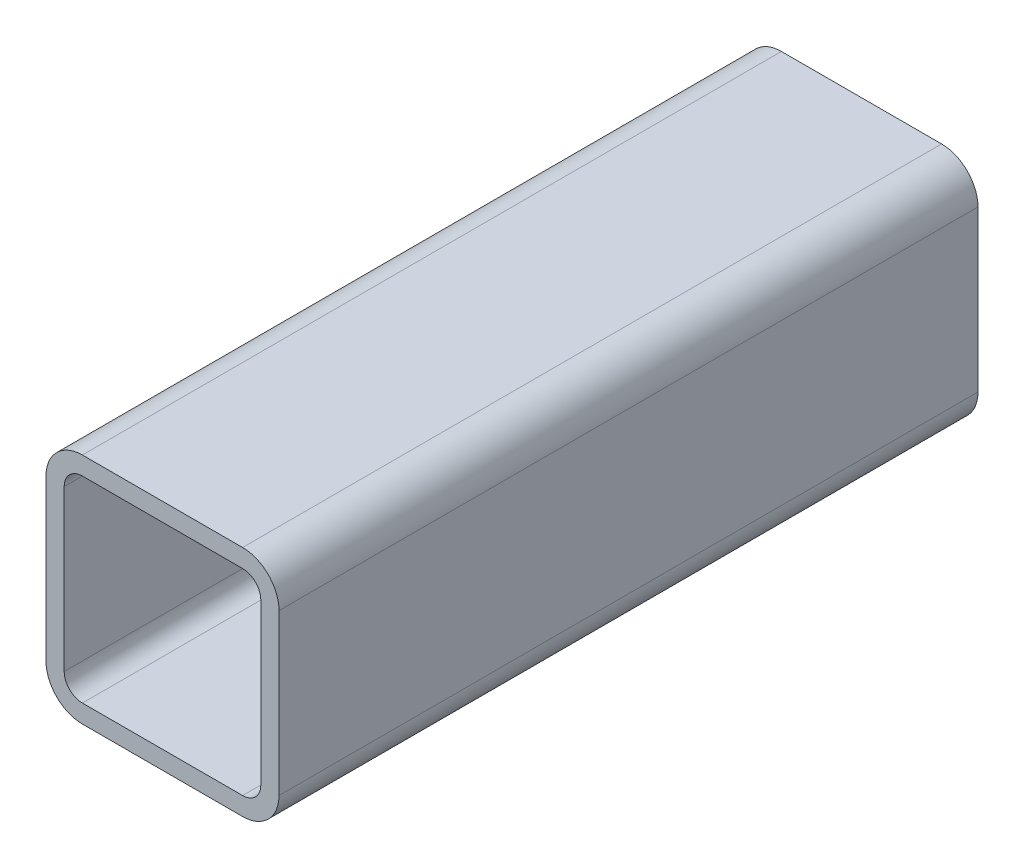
ISO-10303-21;
HEADER;
FILE_DESCRIPTION(('STEP AP214'),'2;1');
FILE_NAME('part.step','',(''),(''),'','','');
FILE_SCHEMA(('AUTOMOTIVE_DESIGN { 1 0 10303 214 1 1 1 1 }'));
ENDSEC;
DATA;
#1=APPLICATION_CONTEXT('core data for automotive mechanical design processes');
#2=APPLICATION_PROTOCOL_DEFINITION('international standard','automotive_design',2000,#1);
#3=PRODUCT_CONTEXT('',#1,'mechanical');
#4=PRODUCT('Part','Part','',(#3));
#5=PRODUCT_RELATED_PRODUCT_CATEGORY('part','',(#4));
#6=PRODUCT_DEFINITION_FORMATION('','',#4);
#7=PRODUCT_DEFINITION_CONTEXT('part definition',#1,'design');
#8=PRODUCT_DEFINITION('design','',#6,#7);
#9=PRODUCT_DEFINITION_SHAPE('','',#8);
#10=(LENGTH_UNIT() NAMED_UNIT(*) SI_UNIT(.MILLI.,.METRE.));
#11=(NAMED_UNIT(*) PLANE_ANGLE_UNIT() SI_UNIT($,.RADIAN.));
#12=(NAMED_UNIT(*) SI_UNIT($,.STERADIAN.) SOLID_ANGLE_UNIT());
#13=UNCERTAINTY_MEASURE_WITH_UNIT(LENGTH_MEASURE(1.E-05),#10,'distance_accuracy_value','');
#14=(GEOMETRIC_REPRESENTATION_CONTEXT(3) GLOBAL_UNCERTAINTY_ASSIGNED_CONTEXT((#13)) GLOBAL_UNIT_ASSIGNED_CONTEXT((#10,
#11,#12)) REPRESENTATION_CONTEXT('',''));
#15=CARTESIAN_POINT('',(0.,0.,0.));
#16=DIRECTION('',(0.,0.,1.));
#17=DIRECTION('',(1.,0.,0.));
#18=AXIS2_PLACEMENT_3D('',#15,#16,#17);
#19=CARTESIAN_POINT('',(17.5501778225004,87.7827651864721,304.8));
#20=DIRECTION('',(0.,0.,1.));
#21=DIRECTION('',(1.,0.,0.));
#22=AXIS2_PLACEMENT_3D('',#19,#20,#21);
#23=PLANE('',#22);
#24=CARTESIAN_POINT('',(17.5501778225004,87.7827651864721,304.8));
#25=DIRECTION('',(0.,0.,1.));
#26=DIRECTION('',(1.,0.,0.));
#27=AXIS2_PLACEMENT_3D('',#24,#25,#26);
#28=CIRCLE('',#27,15.875);
#29=CARTESIAN_POINT('',(17.5501778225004,103.657765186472,304.8));
#30=VERTEX_POINT('',#29);
#31=CARTESIAN_POINT('',(1.67517782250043,87.7827651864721,304.8));
#32=VERTEX_POINT('',#31);
#33=EDGE_CURVE('E211',#30,#32,#28,.T.);
#34=ORIENTED_EDGE('',*,*,#33,.T.);
#35=DIRECTION('',(0.,-1.,0.));
#36=VECTOR('',#35,1.);
#37=CARTESIAN_POINT('',(1.67517782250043,17.9327651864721,304.8));
#38=LINE('',#37,#36);
#39=CARTESIAN_POINT('',(1.67517782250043,17.9327651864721,304.8));
#40=VERTEX_POINT('',#39);
#41=EDGE_CURVE('E214',#32,#40,#38,.T.);
#42=ORIENTED_EDGE('',*,*,#41,.T.);
#43=CARTESIAN_POINT('',(17.5501778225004,17.9327651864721,304.8));
#44=DIRECTION('',(0.,0.,1.));
#45=DIRECTION('',(1.,0.,0.));
#46=AXIS2_PLACEMENT_3D('',#43,#44,#45);
#47=CIRCLE('',#46,15.875);
#48=CARTESIAN_POINT('',(17.5501778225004,2.05776518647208,304.8));
#49=VERTEX_POINT('',#48);
#50=EDGE_CURVE('E217',#40,#49,#47,.T.);
#51=ORIENTED_EDGE('',*,*,#50,.T.);
#52=DIRECTION('',(1.,0.,0.));
#53=VECTOR('',#52,1.);
#54=CARTESIAN_POINT('',(87.4001778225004,2.05776518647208,304.8));
#55=LINE('',#54,#53);
#56=CARTESIAN_POINT('',(87.4001778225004,2.05776518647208,304.8));
#57=VERTEX_POINT('',#56);
#58=EDGE_CURVE('E219',#49,#57,#55,.T.);
#59=ORIENTED_EDGE('',*,*,#58,.T.);
#60=CARTESIAN_POINT('',(87.4001778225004,17.9327651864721,304.8));
#61=DIRECTION('',(0.,0.,1.));
#62=DIRECTION('',(1.,0.,0.));
#63=AXIS2_PLACEMENT_3D('',#60,#61,#62);
#64=CIRCLE('',#63,15.875);
#65=CARTESIAN_POINT('',(103.2751778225,17.9327651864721,304.8));
#66=VERTEX_POINT('',#65);
#67=EDGE_CURVE('E221',#57,#66,#64,.T.);
#68=ORIENTED_EDGE('',*,*,#67,.T.);
#69=DIRECTION('',(0.,1.,0.));
#70=VECTOR('',#69,1.);
#71=CARTESIAN_POINT('',(103.2751778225,87.7827651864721,304.8));
#72=LINE('',#71,#70);
#73=CARTESIAN_POINT('',(103.2751778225,87.7827651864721,304.8));
#74=VERTEX_POINT('',#73);
#75=EDGE_CURVE('E223',#66,#74,#72,.T.);
#76=ORIENTED_EDGE('',*,*,#75,.T.);
#77=CARTESIAN_POINT('',(87.4001778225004,87.7827651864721,304.8));
#78=DIRECTION('',(0.,0.,1.));
#79=DIRECTION('',(1.,0.,0.));
#80=AXIS2_PLACEMENT_3D('',#77,#78,#79);
#81=CIRCLE('',#80,15.875);
#82=CARTESIAN_POINT('',(87.4001778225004,103.657765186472,304.8));
#83=VERTEX_POINT('',#82);
#84=EDGE_CURVE('E225',#74,#83,#81,.T.);
#85=ORIENTED_EDGE('',*,*,#84,.T.);
#86=DIRECTION('',(-1.,0.,0.));
#87=VECTOR('',#86,1.);
#88=CARTESIAN_POINT('',(17.5501778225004,103.657765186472,304.8));
#89=LINE('',#88,#87);
#90=EDGE_CURVE('E227',#83,#30,#89,.T.);
#91=ORIENTED_EDGE('',*,*,#90,.T.);
#92=EDGE_LOOP('',(#34,#42,#51,#59,#68,#76,#85,#91));
#93=FACE_BOUND('',#92,.T.);
#94=DIRECTION('',(0.,-1.,0.));
#95=VECTOR('',#94,1.);
#96=CARTESIAN_POINT('',(9.61267782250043,17.9327651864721,304.8));
#97=LINE('',#96,#95);
#98=CARTESIAN_POINT('',(9.61267782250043,87.7827651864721,304.8));
#99=VERTEX_POINT('',#98);
#100=CARTESIAN_POINT('',(9.61267782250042,17.9327651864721,304.8));
#101=VERTEX_POINT('',#100);
#102=EDGE_CURVE('E154',#99,#101,#97,.T.);
#103=ORIENTED_EDGE('',*,*,#102,.F.);
#104=CARTESIAN_POINT('',(17.5501778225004,87.7827651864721,304.8));
#105=DIRECTION('',(0.,0.,1.));
#106=DIRECTION('',(1.,0.,0.));
#107=AXIS2_PLACEMENT_3D('',#104,#105,#106);
#108=CIRCLE('',#107,7.9375);
#109=CARTESIAN_POINT('',(17.5501778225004,95.7202651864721,304.8));
#110=VERTEX_POINT('',#109);
#111=EDGE_CURVE('E146',#110,#99,#108,.T.);
#112=ORIENTED_EDGE('',*,*,#111,.F.);
#113=DIRECTION('',(-1.,0.,0.));
#114=VECTOR('',#113,1.);
#115=CARTESIAN_POINT('',(17.5501778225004,95.7202651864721,304.8));
#116=LINE('',#115,#114);
#117=CARTESIAN_POINT('',(87.4001778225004,95.7202651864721,304.8));
#118=VERTEX_POINT('',#117);
#119=EDGE_CURVE('E179',#118,#110,#116,.T.);
#120=ORIENTED_EDGE('',*,*,#119,.F.);
#121=CARTESIAN_POINT('',(87.4001778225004,87.7827651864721,304.8));
#122=DIRECTION('',(0.,0.,1.));
#123=DIRECTION('',(1.,0.,0.));
#124=AXIS2_PLACEMENT_3D('',#121,#122,#123);
#125=CIRCLE('',#124,7.9375);
#126=CARTESIAN_POINT('',(95.3376778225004,87.7827651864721,304.8));
#127=VERTEX_POINT('',#126);
#128=EDGE_CURVE('E177',#127,#118,#125,.T.);
#129=ORIENTED_EDGE('',*,*,#128,.F.);
#130=DIRECTION('',(0.,1.,0.));
#131=VECTOR('',#130,1.);
#132=CARTESIAN_POINT('',(95.3376778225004,87.7827651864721,304.8));
#133=LINE('',#132,#131);
#134=CARTESIAN_POINT('',(95.3376778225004,17.9327651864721,304.8));
#135=VERTEX_POINT('',#134);
#136=EDGE_CURVE('E175',#135,#127,#133,.T.);
#137=ORIENTED_EDGE('',*,*,#136,.F.);
#138=CARTESIAN_POINT('',(87.4001778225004,17.9327651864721,304.8));
#139=DIRECTION('',(0.,0.,1.));
#140=DIRECTION('',(1.,0.,0.));
#141=AXIS2_PLACEMENT_3D('',#138,#139,#140);
#142=CIRCLE('',#141,7.9375);
#143=CARTESIAN_POINT('',(87.4001778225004,9.99526518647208,304.8));
#144=VERTEX_POINT('',#143);
#145=EDGE_CURVE('E173',#144,#135,#142,.T.);
#146=ORIENTED_EDGE('',*,*,#145,.F.);
#147=DIRECTION('',(1.,0.,0.));
#148=VECTOR('',#147,1.);
#149=CARTESIAN_POINT('',(87.4001778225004,9.99526518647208,304.8));
#150=LINE('',#149,#148);
#151=CARTESIAN_POINT('',(17.5501778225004,9.99526518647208,304.8));
#152=VERTEX_POINT('',#151);
#153=EDGE_CURVE('E169',#152,#144,#150,.T.);
#154=ORIENTED_EDGE('',*,*,#153,.F.);
#155=CARTESIAN_POINT('',(17.5501778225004,17.9327651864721,304.8));
#156=DIRECTION('',(0.,0.,1.));
#157=DIRECTION('',(1.,0.,0.));
#158=AXIS2_PLACEMENT_3D('',#155,#156,#157);
#159=CIRCLE('',#158,7.9375);
#160=EDGE_CURVE('E167',#101,#152,#159,.T.);
#161=ORIENTED_EDGE('',*,*,#160,.F.);
#162=EDGE_LOOP('',(#103,#112,#120,#129,#137,#146,#154,#161));
#163=FACE_BOUND('',#162,.T.);
#164=ADVANCED_FACE('F33',(#93,#163),#23,.T.);
#165=CARTESIAN_POINT('',(17.5501778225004,87.7827651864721,0.));
#166=DIRECTION('',(0.,0.,1.));
#167=DIRECTION('',(1.,0.,0.));
#168=AXIS2_PLACEMENT_3D('',#165,#166,#167);
#169=PLANE('',#168);
#170=CARTESIAN_POINT('',(17.5501778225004,87.7827651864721,0.));
#171=DIRECTION('',(0.,0.,1.));
#172=DIRECTION('',(1.,0.,0.));
#173=AXIS2_PLACEMENT_3D('',#170,#171,#172);
#174=CIRCLE('',#173,15.875);
#175=CARTESIAN_POINT('',(17.5501778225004,103.657765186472,0.));
#176=VERTEX_POINT('',#175);
#177=CARTESIAN_POINT('',(1.67517782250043,87.7827651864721,0.));
#178=VERTEX_POINT('',#177);
#179=EDGE_CURVE('E162',#176,#178,#174,.T.);
#180=ORIENTED_EDGE('',*,*,#179,.F.);
#181=DIRECTION('',(-1.,0.,0.));
#182=VECTOR('',#181,1.);
#183=CARTESIAN_POINT('',(17.5501778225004,103.657765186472,0.));
#184=LINE('',#183,#182);
#185=CARTESIAN_POINT('',(87.4001778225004,103.657765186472,0.));
#186=VERTEX_POINT('',#185);
#187=EDGE_CURVE('E215',#186,#176,#184,.T.);
#188=ORIENTED_EDGE('',*,*,#187,.F.);
#189=CARTESIAN_POINT('',(87.4001778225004,87.7827651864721,0.));
#190=DIRECTION('',(0.,0.,1.));
#191=DIRECTION('',(1.,0.,0.));
#192=AXIS2_PLACEMENT_3D('',#189,#190,#191);
#193=CIRCLE('',#192,15.875);
#194=CARTESIAN_POINT('',(103.2751778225,87.7827651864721,0.));
#195=VERTEX_POINT('',#194);
#196=EDGE_CURVE('E242',#195,#186,#193,.T.);
#197=ORIENTED_EDGE('',*,*,#196,.F.);
#198=DIRECTION('',(0.,1.,0.));
#199=VECTOR('',#198,1.);
#200=CARTESIAN_POINT('',(103.2751778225,87.7827651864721,0.));
#201=LINE('',#200,#199);
#202=CARTESIAN_POINT('',(103.2751778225,17.9327651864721,0.));
#203=VERTEX_POINT('',#202);
#204=EDGE_CURVE('E240',#203,#195,#201,.T.);
#205=ORIENTED_EDGE('',*,*,#204,.F.);
#206=CARTESIAN_POINT('',(87.4001778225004,17.9327651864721,0.));
#207=DIRECTION('',(0.,0.,1.));
#208=DIRECTION('',(1.,0.,0.));
#209=AXIS2_PLACEMENT_3D('',#206,#207,#208);
#210=CIRCLE('',#209,15.875);
#211=CARTESIAN_POINT('',(87.4001778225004,2.05776518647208,0.));
#212=VERTEX_POINT('',#211);
#213=EDGE_CURVE('E238',#212,#203,#210,.T.);
#214=ORIENTED_EDGE('',*,*,#213,.F.);
#215=DIRECTION('',(1.,0.,0.));
#216=VECTOR('',#215,1.);
#217=CARTESIAN_POINT('',(87.4001778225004,2.05776518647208,0.));
#218=LINE('',#217,#216);
#219=CARTESIAN_POINT('',(17.5501778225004,2.05776518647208,0.));
#220=VERTEX_POINT('',#219);
#221=EDGE_CURVE('E236',#220,#212,#218,.T.);
#222=ORIENTED_EDGE('',*,*,#221,.F.);
#223=CARTESIAN_POINT('',(17.5501778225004,17.9327651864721,0.));
#224=DIRECTION('',(0.,0.,1.));
#225=DIRECTION('',(1.,0.,0.));
#226=AXIS2_PLACEMENT_3D('',#223,#224,#225);
#227=CIRCLE('',#226,15.875);
#228=CARTESIAN_POINT('',(1.67517782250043,17.9327651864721,0.));
#229=VERTEX_POINT('',#228);
#230=EDGE_CURVE('E234',#229,#220,#227,.T.);
#231=ORIENTED_EDGE('',*,*,#230,.F.);
#232=DIRECTION('',(0.,-1.,0.));
#233=VECTOR('',#232,1.);
#234=CARTESIAN_POINT('',(1.67517782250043,17.9327651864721,0.));
#235=LINE('',#234,#233);
#236=EDGE_CURVE('E232',#178,#229,#235,.T.);
#237=ORIENTED_EDGE('',*,*,#236,.F.);
#238=EDGE_LOOP('',(#180,#188,#197,#205,#214,#222,#231,#237));
#239=FACE_BOUND('',#238,.T.);
#240=CARTESIAN_POINT('',(17.5501778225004,87.7827651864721,0.));
#241=DIRECTION('',(0.,0.,1.));
#242=DIRECTION('',(1.,0.,0.));
#243=AXIS2_PLACEMENT_3D('',#240,#241,#242);
#244=CIRCLE('',#243,7.9375);
#245=CARTESIAN_POINT('',(17.5501778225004,95.7202651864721,0.));
#246=VERTEX_POINT('',#245);
#247=CARTESIAN_POINT('',(9.61267782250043,87.7827651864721,0.));
#248=VERTEX_POINT('',#247);
#249=EDGE_CURVE('E56',#246,#248,#244,.T.);
#250=ORIENTED_EDGE('',*,*,#249,.T.);
#251=DIRECTION('',(0.,-1.,0.));
#252=VECTOR('',#251,1.);
#253=CARTESIAN_POINT('',(9.61267782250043,17.9327651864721,0.));
#254=LINE('',#253,#252);
#255=CARTESIAN_POINT('',(9.61267782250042,17.9327651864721,0.));
#256=VERTEX_POINT('',#255);
#257=EDGE_CURVE('E161',#248,#256,#254,.T.);
#258=ORIENTED_EDGE('',*,*,#257,.T.);
#259=CARTESIAN_POINT('',(17.5501778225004,17.9327651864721,0.));
#260=DIRECTION('',(0.,0.,1.));
#261=DIRECTION('',(1.,0.,0.));
#262=AXIS2_PLACEMENT_3D('',#259,#260,#261);
#263=CIRCLE('',#262,7.9375);
#264=CARTESIAN_POINT('',(17.5501778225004,9.99526518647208,0.));
#265=VERTEX_POINT('',#264);
#266=EDGE_CURVE('E183',#256,#265,#263,.T.);
#267=ORIENTED_EDGE('',*,*,#266,.T.);
#268=DIRECTION('',(1.,0.,0.));
#269=VECTOR('',#268,1.);
#270=CARTESIAN_POINT('',(87.4001778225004,9.99526518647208,0.));
#271=LINE('',#270,#269);
#272=CARTESIAN_POINT('',(87.4001778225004,9.99526518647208,0.));
#273=VERTEX_POINT('',#272);
#274=EDGE_CURVE('E186',#265,#273,#271,.T.);
#275=ORIENTED_EDGE('',*,*,#274,.T.);
#276=CARTESIAN_POINT('',(87.4001778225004,17.9327651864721,0.));
#277=DIRECTION('',(0.,0.,1.));
#278=DIRECTION('',(1.,0.,0.));
#279=AXIS2_PLACEMENT_3D('',#276,#277,#278);
#280=CIRCLE('',#279,7.9375);
#281=CARTESIAN_POINT('',(95.3376778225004,17.9327651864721,0.));
#282=VERTEX_POINT('',#281);
#283=EDGE_CURVE('E189',#273,#282,#280,.T.);
#284=ORIENTED_EDGE('',*,*,#283,.T.);
#285=DIRECTION('',(0.,1.,0.));
#286=VECTOR('',#285,1.);
#287=CARTESIAN_POINT('',(95.3376778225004,87.7827651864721,0.));
#288=LINE('',#287,#286);
#289=CARTESIAN_POINT('',(95.3376778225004,87.7827651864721,0.));
#290=VERTEX_POINT('',#289);
#291=EDGE_CURVE('E192',#282,#290,#288,.T.);
#292=ORIENTED_EDGE('',*,*,#291,.T.);
#293=CARTESIAN_POINT('',(87.4001778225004,87.7827651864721,0.));
#294=DIRECTION('',(0.,0.,1.));
#295=DIRECTION('',(1.,0.,0.));
#296=AXIS2_PLACEMENT_3D('',#293,#294,#295);
#297=CIRCLE('',#296,7.9375);
#298=CARTESIAN_POINT('',(87.4001778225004,95.7202651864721,0.));
#299=VERTEX_POINT('',#298);
#300=EDGE_CURVE('E195',#290,#299,#297,.T.);
#301=ORIENTED_EDGE('',*,*,#300,.T.);
#302=DIRECTION('',(-1.,0.,0.));
#303=VECTOR('',#302,1.);
#304=CARTESIAN_POINT('',(17.5501778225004,95.7202651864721,0.));
#305=LINE('',#304,#303);
#306=EDGE_CURVE('E155',#299,#246,#305,.T.);
#307=ORIENTED_EDGE('',*,*,#306,.T.);
#308=EDGE_LOOP('',(#250,#258,#267,#275,#284,#292,#301,#307));
#309=FACE_BOUND('',#308,.T.);
#310=ADVANCED_FACE('F272',(#239,#309),#169,.F.);
#311=CARTESIAN_POINT('',(17.5501778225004,87.7827651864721,304.8));
#312=DIRECTION('',(0.,0.,-1.));
#313=DIRECTION('',(-1.,0.,0.));
#314=AXIS2_PLACEMENT_3D('',#311,#312,#313);
#315=CYLINDRICAL_SURFACE('',#314,15.875);
#316=ORIENTED_EDGE('',*,*,#179,.T.);
#317=DIRECTION('',(0.,0.,-1.));
#318=VECTOR('',#317,1.);
#319=CARTESIAN_POINT('',(1.67517782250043,87.7827651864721,304.8));
#320=LINE('',#319,#318);
#321=EDGE_CURVE('E11',#32,#178,#320,.T.);
#322=ORIENTED_EDGE('',*,*,#321,.F.);
#323=ORIENTED_EDGE('',*,*,#33,.F.);
#324=DIRECTION('',(0.,0.,-1.));
#325=VECTOR('',#324,1.);
#326=CARTESIAN_POINT('',(17.5501778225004,103.657765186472,304.8));
#327=LINE('',#326,#325);
#328=EDGE_CURVE('E229',#30,#176,#327,.T.);
#329=ORIENTED_EDGE('',*,*,#328,.T.);
#330=EDGE_LOOP('',(#316,#322,#323,#329));
#331=FACE_BOUND('',#330,.T.);
#332=ADVANCED_FACE('F35',(#331),#315,.T.);
#333=CARTESIAN_POINT('',(1.67517782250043,17.9327651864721,304.8));
#334=DIRECTION('',(1.,0.,0.));
#335=DIRECTION('',(0.,0.,-1.));
#336=AXIS2_PLACEMENT_3D('',#333,#334,#335);
#337=PLANE('',#336);
#338=ORIENTED_EDGE('',*,*,#236,.T.);
#339=DIRECTION('',(0.,0.,-1.));
#340=VECTOR('',#339,1.);
#341=CARTESIAN_POINT('',(1.67517782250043,17.9327651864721,304.8));
#342=LINE('',#341,#340);
#343=EDGE_CURVE('E41',#40,#229,#342,.T.);
#344=ORIENTED_EDGE('',*,*,#343,.F.);
#345=ORIENTED_EDGE('',*,*,#41,.F.);
#346=ORIENTED_EDGE('',*,*,#321,.T.);
#347=EDGE_LOOP('',(#338,#344,#345,#346));
#348=FACE_BOUND('',#347,.T.);
#349=ADVANCED_FACE('F289',(#348),#337,.F.);
#350=CARTESIAN_POINT('',(17.5501778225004,17.9327651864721,304.8));
#351=DIRECTION('',(0.,0.,-1.));
#352=DIRECTION('',(-1.,0.,0.));
#353=AXIS2_PLACEMENT_3D('',#350,#351,#352);
#354=CYLINDRICAL_SURFACE('',#353,15.875);
#355=ORIENTED_EDGE('',*,*,#230,.T.);
#356=DIRECTION('',(0.,0.,-1.));
#357=VECTOR('',#356,1.);
#358=CARTESIAN_POINT('',(17.5501778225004,2.05776518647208,304.8));
#359=LINE('',#358,#357);
#360=EDGE_CURVE('E259',#49,#220,#359,.T.);
#361=ORIENTED_EDGE('',*,*,#360,.F.);
#362=ORIENTED_EDGE('',*,*,#50,.F.);
#363=ORIENTED_EDGE('',*,*,#343,.T.);
#364=EDGE_LOOP('',(#355,#361,#362,#363));
#365=FACE_BOUND('',#364,.T.);
#366=ADVANCED_FACE('F266',(#365),#354,.T.);
#367=CARTESIAN_POINT('',(87.4001778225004,2.05776518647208,304.8));
#368=DIRECTION('',(0.,1.,0.));
#369=DIRECTION('',(0.,0.,1.));
#370=AXIS2_PLACEMENT_3D('',#367,#368,#369);
#371=PLANE('',#370);
#372=ORIENTED_EDGE('',*,*,#221,.T.);
#373=DIRECTION('',(0.,0.,-1.));
#374=VECTOR('',#373,1.);
#375=CARTESIAN_POINT('',(87.4001778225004,2.05776518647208,304.8));
#376=LINE('',#375,#374);
#377=EDGE_CURVE('E256',#57,#212,#376,.T.);
#378=ORIENTED_EDGE('',*,*,#377,.F.);
#379=ORIENTED_EDGE('',*,*,#58,.F.);
#380=ORIENTED_EDGE('',*,*,#360,.T.);
#381=EDGE_LOOP('',(#372,#378,#379,#380));
#382=FACE_BOUND('',#381,.T.);
#383=ADVANCED_FACE('F278',(#382),#371,.F.);
#384=CARTESIAN_POINT('',(87.4001778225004,17.9327651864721,304.8));
#385=DIRECTION('',(0.,0.,-1.));
#386=DIRECTION('',(-1.,0.,0.));
#387=AXIS2_PLACEMENT_3D('',#384,#385,#386);
#388=CYLINDRICAL_SURFACE('',#387,15.875);
#389=ORIENTED_EDGE('',*,*,#213,.T.);
#390=DIRECTION('',(0.,0.,-1.));
#391=VECTOR('',#390,1.);
#392=CARTESIAN_POINT('',(103.2751778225,17.9327651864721,304.8));
#393=LINE('',#392,#391);
#394=EDGE_CURVE('E253',#66,#203,#393,.T.);
#395=ORIENTED_EDGE('',*,*,#394,.F.);
#396=ORIENTED_EDGE('',*,*,#67,.F.);
#397=ORIENTED_EDGE('',*,*,#377,.T.);
#398=EDGE_LOOP('',(#389,#395,#396,#397));
#399=FACE_BOUND('',#398,.T.);
#400=ADVANCED_FACE('F282',(#399),#388,.T.);
#401=CARTESIAN_POINT('',(103.2751778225,87.7827651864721,304.8));
#402=DIRECTION('',(-1.,0.,0.));
#403=DIRECTION('',(0.,0.,1.));
#404=AXIS2_PLACEMENT_3D('',#401,#402,#403);
#405=PLANE('',#404);
#406=ORIENTED_EDGE('',*,*,#204,.T.);
#407=DIRECTION('',(0.,0.,-1.));
#408=VECTOR('',#407,1.);
#409=CARTESIAN_POINT('',(103.2751778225,87.7827651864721,304.8));
#410=LINE('',#409,#408);
#411=EDGE_CURVE('E250',#74,#195,#410,.T.);
#412=ORIENTED_EDGE('',*,*,#411,.F.);
#413=ORIENTED_EDGE('',*,*,#75,.F.);
#414=ORIENTED_EDGE('',*,*,#394,.T.);
#415=EDGE_LOOP('',(#406,#412,#413,#414));
#416=FACE_BOUND('',#415,.T.);
#417=ADVANCED_FACE('F302',(#416),#405,.F.);
#418=CARTESIAN_POINT('',(87.4001778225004,87.7827651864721,304.8));
#419=DIRECTION('',(0.,0.,-1.));
#420=DIRECTION('',(-1.,0.,0.));
#421=AXIS2_PLACEMENT_3D('',#418,#419,#420);
#422=CYLINDRICAL_SURFACE('',#421,15.875);
#423=ORIENTED_EDGE('',*,*,#196,.T.);
#424=DIRECTION('',(0.,0.,-1.));
#425=VECTOR('',#424,1.);
#426=CARTESIAN_POINT('',(87.4001778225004,103.657765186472,304.8));
#427=LINE('',#426,#425);
#428=EDGE_CURVE('E247',#83,#186,#427,.T.);
#429=ORIENTED_EDGE('',*,*,#428,.F.);
#430=ORIENTED_EDGE('',*,*,#84,.F.);
#431=ORIENTED_EDGE('',*,*,#411,.T.);
#432=EDGE_LOOP('',(#423,#429,#430,#431));
#433=FACE_BOUND('',#432,.T.);
#434=ADVANCED_FACE('F300',(#433),#422,.T.);
#435=CARTESIAN_POINT('',(17.5501778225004,103.657765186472,304.8));
#436=DIRECTION('',(0.,-1.,0.));
#437=DIRECTION('',(0.,0.,-1.));
#438=AXIS2_PLACEMENT_3D('',#435,#436,#437);
#439=PLANE('',#438);
#440=ORIENTED_EDGE('',*,*,#187,.T.);
#441=ORIENTED_EDGE('',*,*,#328,.F.);
#442=ORIENTED_EDGE('',*,*,#90,.F.);
#443=ORIENTED_EDGE('',*,*,#428,.T.);
#444=EDGE_LOOP('',(#440,#441,#442,#443));
#445=FACE_BOUND('',#444,.T.);
#446=ADVANCED_FACE('F295',(#445),#439,.F.);
#447=CARTESIAN_POINT('',(17.5501778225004,87.7827651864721,304.8));
#448=DIRECTION('',(0.,0.,-1.));
#449=DIRECTION('',(-1.,0.,0.));
#450=AXIS2_PLACEMENT_3D('',#447,#448,#449);
#451=CYLINDRICAL_SURFACE('',#450,7.9375);
#452=ORIENTED_EDGE('',*,*,#249,.F.);
#453=DIRECTION('',(0.,0.,-1.));
#454=VECTOR('',#453,1.);
#455=CARTESIAN_POINT('',(17.5501778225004,95.7202651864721,304.8));
#456=LINE('',#455,#454);
#457=EDGE_CURVE('E150',#110,#246,#456,.T.);
#458=ORIENTED_EDGE('',*,*,#457,.F.);
#459=ORIENTED_EDGE('',*,*,#111,.T.);
#460=DIRECTION('',(0.,0.,-1.));
#461=VECTOR('',#460,1.);
#462=CARTESIAN_POINT('',(9.61267782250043,87.7827651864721,304.8));
#463=LINE('',#462,#461);
#464=EDGE_CURVE('E149',#99,#248,#463,.T.);
#465=ORIENTED_EDGE('',*,*,#464,.T.);
#466=EDGE_LOOP('',(#452,#458,#459,#465));
#467=FACE_BOUND('',#466,.T.);
#468=ADVANCED_FACE('F148',(#467),#451,.F.);
#469=CARTESIAN_POINT('',(9.61267782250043,17.9327651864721,304.8));
#470=DIRECTION('',(1.,0.,0.));
#471=DIRECTION('',(0.,0.,-1.));
#472=AXIS2_PLACEMENT_3D('',#469,#470,#471);
#473=PLANE('',#472);
#474=ORIENTED_EDGE('',*,*,#257,.F.);
#475=ORIENTED_EDGE('',*,*,#464,.F.);
#476=ORIENTED_EDGE('',*,*,#102,.T.);
#477=DIRECTION('',(0.,0.,-1.));
#478=VECTOR('',#477,1.);
#479=CARTESIAN_POINT('',(9.61267782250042,17.9327651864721,304.8));
#480=LINE('',#479,#478);
#481=EDGE_CURVE('E163',#101,#256,#480,.T.);
#482=ORIENTED_EDGE('',*,*,#481,.T.);
#483=EDGE_LOOP('',(#474,#475,#476,#482));
#484=FACE_BOUND('',#483,.T.);
#485=ADVANCED_FACE('F158',(#484),#473,.T.);
#486=CARTESIAN_POINT('',(17.5501778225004,17.9327651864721,304.8));
#487=DIRECTION('',(0.,0.,-1.));
#488=DIRECTION('',(-1.,0.,0.));
#489=AXIS2_PLACEMENT_3D('',#486,#487,#488);
#490=CYLINDRICAL_SURFACE('',#489,7.9375);
#491=ORIENTED_EDGE('',*,*,#266,.F.);
#492=ORIENTED_EDGE('',*,*,#481,.F.);
#493=ORIENTED_EDGE('',*,*,#160,.T.);
#494=DIRECTION('',(0.,0.,-1.));
#495=VECTOR('',#494,1.);
#496=CARTESIAN_POINT('',(17.5501778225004,9.99526518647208,304.8));
#497=LINE('',#496,#495);
#498=EDGE_CURVE('E208',#152,#265,#497,.T.);
#499=ORIENTED_EDGE('',*,*,#498,.T.);
#500=EDGE_LOOP('',(#491,#492,#493,#499));
#501=FACE_BOUND('',#500,.T.);
#502=ADVANCED_FACE('F327',(#501),#490,.F.);
#503=CARTESIAN_POINT('',(87.4001778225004,9.99526518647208,304.8));
#504=DIRECTION('',(0.,1.,0.));
#505=DIRECTION('',(0.,0.,1.));
#506=AXIS2_PLACEMENT_3D('',#503,#504,#505);
#507=PLANE('',#506);
#508=ORIENTED_EDGE('',*,*,#274,.F.);
#509=ORIENTED_EDGE('',*,*,#498,.F.);
#510=ORIENTED_EDGE('',*,*,#153,.T.);
#511=DIRECTION('',(0.,0.,-1.));
#512=VECTOR('',#511,1.);
#513=CARTESIAN_POINT('',(87.4001778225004,9.99526518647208,304.8));
#514=LINE('',#513,#512);
#515=EDGE_CURVE('E206',#144,#273,#514,.T.);
#516=ORIENTED_EDGE('',*,*,#515,.T.);
#517=EDGE_LOOP('',(#508,#509,#510,#516));
#518=FACE_BOUND('',#517,.T.);
#519=ADVANCED_FACE('F331',(#518),#507,.T.);
#520=CARTESIAN_POINT('',(87.4001778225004,17.9327651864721,304.8));
#521=DIRECTION('',(0.,0.,-1.));
#522=DIRECTION('',(-1.,0.,0.));
#523=AXIS2_PLACEMENT_3D('',#520,#521,#522);
#524=CYLINDRICAL_SURFACE('',#523,7.9375);
#525=ORIENTED_EDGE('',*,*,#283,.F.);
#526=ORIENTED_EDGE('',*,*,#515,.F.);
#527=ORIENTED_EDGE('',*,*,#145,.T.);
#528=DIRECTION('',(0.,0.,-1.));
#529=VECTOR('',#528,1.);
#530=CARTESIAN_POINT('',(95.3376778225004,17.9327651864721,304.8));
#531=LINE('',#530,#529);
#532=EDGE_CURVE('E204',#135,#282,#531,.T.);
#533=ORIENTED_EDGE('',*,*,#532,.T.);
#534=EDGE_LOOP('',(#525,#526,#527,#533));
#535=FACE_BOUND('',#534,.T.);
#536=ADVANCED_FACE('F337',(#535),#524,.F.);
#537=CARTESIAN_POINT('',(95.3376778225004,87.7827651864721,304.8));
#538=DIRECTION('',(-1.,0.,0.));
#539=DIRECTION('',(0.,0.,1.));
#540=AXIS2_PLACEMENT_3D('',#537,#538,#539);
#541=PLANE('',#540);
#542=ORIENTED_EDGE('',*,*,#291,.F.);
#543=ORIENTED_EDGE('',*,*,#532,.F.);
#544=ORIENTED_EDGE('',*,*,#136,.T.);
#545=DIRECTION('',(0.,0.,-1.));
#546=VECTOR('',#545,1.);
#547=CARTESIAN_POINT('',(95.3376778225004,87.7827651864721,304.8));
#548=LINE('',#547,#546);
#549=EDGE_CURVE('E202',#127,#290,#548,.T.);
#550=ORIENTED_EDGE('',*,*,#549,.T.);
#551=EDGE_LOOP('',(#542,#543,#544,#550));
#552=FACE_BOUND('',#551,.T.);
#553=ADVANCED_FACE('F341',(#552),#541,.T.);
#554=CARTESIAN_POINT('',(87.4001778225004,87.7827651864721,304.8));
#555=DIRECTION('',(0.,0.,-1.));
#556=DIRECTION('',(-1.,0.,0.));
#557=AXIS2_PLACEMENT_3D('',#554,#555,#556);
#558=CYLINDRICAL_SURFACE('',#557,7.9375);
#559=ORIENTED_EDGE('',*,*,#300,.F.);
#560=ORIENTED_EDGE('',*,*,#549,.F.);
#561=ORIENTED_EDGE('',*,*,#128,.T.);
#562=DIRECTION('',(0.,0.,-1.));
#563=VECTOR('',#562,1.);
#564=CARTESIAN_POINT('',(87.4001778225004,95.7202651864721,304.8));
#565=LINE('',#564,#563);
#566=EDGE_CURVE('E48',#118,#299,#565,.T.);
#567=ORIENTED_EDGE('',*,*,#566,.T.);
#568=EDGE_LOOP('',(#559,#560,#561,#567));
#569=FACE_BOUND('',#568,.T.);
#570=ADVANCED_FACE('F345',(#569),#558,.F.);
#571=CARTESIAN_POINT('',(17.5501778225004,95.7202651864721,304.8));
#572=DIRECTION('',(0.,-1.,0.));
#573=DIRECTION('',(0.,0.,-1.));
#574=AXIS2_PLACEMENT_3D('',#571,#572,#573);
#575=PLANE('',#574);
#576=ORIENTED_EDGE('',*,*,#306,.F.);
#577=ORIENTED_EDGE('',*,*,#566,.F.);
#578=ORIENTED_EDGE('',*,*,#119,.T.);
#579=ORIENTED_EDGE('',*,*,#457,.T.);
#580=EDGE_LOOP('',(#576,#577,#578,#579));
#581=FACE_BOUND('',#580,.T.);
#582=ADVANCED_FACE('F349',(#581),#575,.T.);
#583=CLOSED_SHELL('',(#164,#310,#332,#349,#366,#383,#400,#417,#434,#446,#468,#485,#502,#519,
#536,#553,#570,#582));
#584=MANIFOLD_SOLID_BREP('B2',#583);
#585=ADVANCED_BREP_SHAPE_REPRESENTATION('',(#18,#584),#14);
#586=SHAPE_DEFINITION_REPRESENTATION(#9,#585);
ENDSEC;
END-ISO-10303-21;
